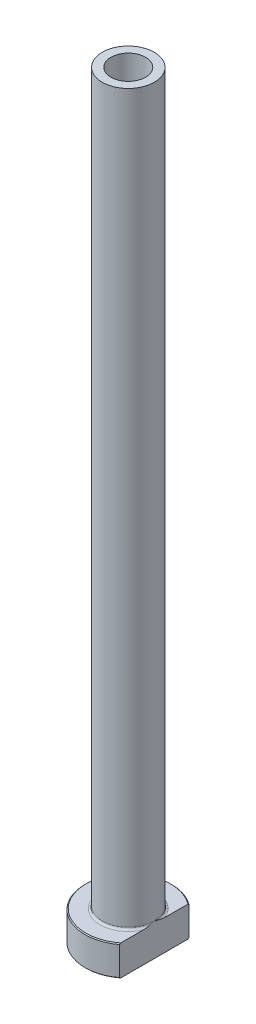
ISO-10303-21;
HEADER;
FILE_DESCRIPTION(('STEP AP214'),'2;1');
FILE_NAME('part.step','',(''),(''),'','','');
FILE_SCHEMA(('AUTOMOTIVE_DESIGN { 1 0 10303 214 1 1 1 1 }'));
ENDSEC;
DATA;
#1=APPLICATION_CONTEXT('core data for automotive mechanical design processes');
#2=APPLICATION_PROTOCOL_DEFINITION('international standard','automotive_design',2000,#1);
#3=PRODUCT_CONTEXT('',#1,'mechanical');
#4=PRODUCT('Part','Part','',(#3));
#5=PRODUCT_RELATED_PRODUCT_CATEGORY('part','',(#4));
#6=PRODUCT_DEFINITION_FORMATION('','',#4);
#7=PRODUCT_DEFINITION_CONTEXT('part definition',#1,'design');
#8=PRODUCT_DEFINITION('design','',#6,#7);
#9=PRODUCT_DEFINITION_SHAPE('','',#8);
#10=(LENGTH_UNIT() NAMED_UNIT(*) SI_UNIT(.MILLI.,.METRE.));
#11=(NAMED_UNIT(*) PLANE_ANGLE_UNIT() SI_UNIT($,.RADIAN.));
#12=(NAMED_UNIT(*) SI_UNIT($,.STERADIAN.) SOLID_ANGLE_UNIT());
#13=UNCERTAINTY_MEASURE_WITH_UNIT(LENGTH_MEASURE(1.E-05),#10,'distance_accuracy_value','');
#14=(GEOMETRIC_REPRESENTATION_CONTEXT(3) GLOBAL_UNCERTAINTY_ASSIGNED_CONTEXT((#13)) GLOBAL_UNIT_ASSIGNED_CONTEXT((#10,
#11,#12)) REPRESENTATION_CONTEXT('',''));
#15=CARTESIAN_POINT('',(0.,0.,0.));
#16=DIRECTION('',(0.,0.,1.));
#17=DIRECTION('',(1.,0.,0.));
#18=AXIS2_PLACEMENT_3D('',#15,#16,#17);
#19=CARTESIAN_POINT('',(0.,92.1876809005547,0.));
#20=DIRECTION('',(0.,1.,0.));
#21=DIRECTION('',(0.,0.,1.));
#22=AXIS2_PLACEMENT_3D('',#19,#20,#21);
#23=CYLINDRICAL_SURFACE('',#22,4.);
#24=CARTESIAN_POINT('',(0.,175.,0.));
#25=DIRECTION('',(0.,1.,0.));
#26=DIRECTION('',(0.,0.,1.));
#27=AXIS2_PLACEMENT_3D('',#24,#25,#26);
#28=CIRCLE('',#27,4.);
#29=CARTESIAN_POINT('',(0.,175.,4.));
#30=VERTEX_POINT('',#29);
#31=EDGE_CURVE('E167',#30,#30,#28,.T.);
#32=ORIENTED_EDGE('',*,*,#31,.T.);
#33=EDGE_LOOP('',(#32));
#34=FACE_BOUND('',#33,.T.);
#35=CARTESIAN_POINT('',(0.,130.,0.));
#36=DIRECTION('',(0.,1.,0.));
#37=DIRECTION('',(0.,0.,1.));
#38=AXIS2_PLACEMENT_3D('',#35,#36,#37);
#39=CIRCLE('',#38,4.);
#40=CARTESIAN_POINT('',(0.,130.,4.));
#41=VERTEX_POINT('',#40);
#42=EDGE_CURVE('E170',#41,#41,#39,.T.);
#43=ORIENTED_EDGE('',*,*,#42,.F.);
#44=EDGE_LOOP('',(#43));
#45=FACE_BOUND('',#44,.T.);
#46=ADVANCED_FACE('F32',(#34,#45),#23,.F.);
#47=CARTESIAN_POINT('',(-4.,175.,0.));
#48=DIRECTION('',(0.,1.,0.));
#49=DIRECTION('',(0.,0.,1.));
#50=AXIS2_PLACEMENT_3D('',#47,#48,#49);
#51=PLANE('',#50);
#52=CARTESIAN_POINT('',(0.,175.,0.));
#53=DIRECTION('',(0.,1.,0.));
#54=DIRECTION('',(0.,0.,1.));
#55=AXIS2_PLACEMENT_3D('',#52,#53,#54);
#56=CIRCLE('',#55,6.00000000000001);
#57=CARTESIAN_POINT('',(0.,175.,6.00000000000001));
#58=VERTEX_POINT('',#57);
#59=EDGE_CURVE('E174',#58,#58,#56,.T.);
#60=ORIENTED_EDGE('',*,*,#59,.T.);
#61=EDGE_LOOP('',(#60));
#62=FACE_BOUND('',#61,.T.);
#63=ORIENTED_EDGE('',*,*,#31,.F.);
#64=EDGE_LOOP('',(#63));
#65=FACE_BOUND('',#64,.T.);
#66=ADVANCED_FACE('F157',(#62,#65),#51,.T.);
#67=CARTESIAN_POINT('',(0.,92.1876809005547,0.));
#68=DIRECTION('',(0.,1.,0.));
#69=DIRECTION('',(0.,0.,1.));
#70=AXIS2_PLACEMENT_3D('',#67,#68,#69);
#71=CYLINDRICAL_SURFACE('',#70,6.);
#72=CARTESIAN_POINT('',(0.,7.50000000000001,0.));
#73=DIRECTION('',(0.,1.,0.));
#74=DIRECTION('',(0.,0.,1.));
#75=AXIS2_PLACEMENT_3D('',#72,#73,#74);
#76=CIRCLE('',#75,6.);
#77=CARTESIAN_POINT('',(6.,7.50000000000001,0.));
#78=VERTEX_POINT('',#77);
#79=EDGE_CURVE('E180',#78,#78,#76,.T.);
#80=ORIENTED_EDGE('',*,*,#79,.T.);
#81=EDGE_LOOP('',(#80));
#82=FACE_BOUND('',#81,.T.);
#83=ORIENTED_EDGE('',*,*,#59,.F.);
#84=EDGE_LOOP('',(#83));
#85=FACE_BOUND('',#84,.T.);
#86=ADVANCED_FACE('F162',(#82,#85),#71,.T.);
#87=CARTESIAN_POINT('',(-5.99999999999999,7.,0.));
#88=DIRECTION('',(0.,1.,0.));
#89=DIRECTION('',(0.,0.,1.));
#90=AXIS2_PLACEMENT_3D('',#87,#88,#89);
#91=PLANE('',#90);
#92=DIRECTION('',(0.,0.,1.));
#93=VECTOR('',#92,1.);
#94=CARTESIAN_POINT('',(6.,7.,0.));
#95=LINE('',#94,#93);
#96=CARTESIAN_POINT('',(6.,7.,-7.74854825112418));
#97=VERTEX_POINT('',#96);
#98=CARTESIAN_POINT('',(6.,7.,-2.50000000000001));
#99=VERTEX_POINT('',#98);
#100=EDGE_CURVE('E54',#97,#99,#95,.T.);
#101=ORIENTED_EDGE('',*,*,#100,.F.);
#102=CARTESIAN_POINT('',(0.,7.,0.));
#103=DIRECTION('',(0.,1.,0.));
#104=DIRECTION('',(0.,0.,1.));
#105=AXIS2_PLACEMENT_3D('',#102,#103,#104);
#106=CIRCLE('',#105,9.79999999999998);
#107=CARTESIAN_POINT('',(5.99999999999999,7.,7.74854825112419));
#108=VERTEX_POINT('',#107);
#109=EDGE_CURVE('E186',#97,#108,#106,.T.);
#110=ORIENTED_EDGE('',*,*,#109,.T.);
#111=CARTESIAN_POINT('',(6.,7.,2.50000000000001));
#112=VERTEX_POINT('',#111);
#113=EDGE_CURVE('E134',#112,#108,#95,.T.);
#114=ORIENTED_EDGE('',*,*,#113,.F.);
#115=CARTESIAN_POINT('',(0.,7.,0.));
#116=DIRECTION('',(0.,1.,0.));
#117=DIRECTION('',(0.,0.,1.));
#118=AXIS2_PLACEMENT_3D('',#115,#116,#117);
#119=CIRCLE('',#118,6.5);
#120=EDGE_CURVE('E183',#112,#99,#119,.F.);
#121=ORIENTED_EDGE('',*,*,#120,.T.);
#122=EDGE_LOOP('',(#101,#110,#114,#121));
#123=FACE_BOUND('',#122,.T.);
#124=ADVANCED_FACE('F197',(#123),#91,.T.);
#125=CARTESIAN_POINT('',(0.,92.1876809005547,0.));
#126=DIRECTION('',(0.,1.,0.));
#127=DIRECTION('',(0.,0.,1.));
#128=AXIS2_PLACEMENT_3D('',#125,#126,#127);
#129=CYLINDRICAL_SURFACE('',#128,9.99999999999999);
#130=DIRECTION('',(0.,-1.,0.));
#131=VECTOR('',#130,1.);
#132=CARTESIAN_POINT('',(5.99999999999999,175.,7.99999999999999));
#133=LINE('',#132,#131);
#134=CARTESIAN_POINT('',(5.99999999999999,6.8,7.99999999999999));
#135=VERTEX_POINT('',#134);
#136=CARTESIAN_POINT('',(5.99999999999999,0.200000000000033,7.99999999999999));
#137=VERTEX_POINT('',#136);
#138=EDGE_CURVE('E82',#135,#137,#133,.T.);
#139=ORIENTED_EDGE('',*,*,#138,.F.);
#140=CARTESIAN_POINT('',(0.,6.8,0.));
#141=DIRECTION('',(0.,1.,0.));
#142=DIRECTION('',(0.,0.,1.));
#143=AXIS2_PLACEMENT_3D('',#140,#141,#142);
#144=CIRCLE('',#143,9.99999999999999);
#145=CARTESIAN_POINT('',(6.,6.8,-7.99999999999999));
#146=VERTEX_POINT('',#145);
#147=EDGE_CURVE('E95',#135,#146,#144,.F.);
#148=ORIENTED_EDGE('',*,*,#147,.T.);
#149=DIRECTION('',(0.,-1.,0.));
#150=VECTOR('',#149,1.);
#151=CARTESIAN_POINT('',(6.,175.,-7.99999999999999));
#152=LINE('',#151,#150);
#153=CARTESIAN_POINT('',(6.,0.200000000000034,-7.99999999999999));
#154=VERTEX_POINT('',#153);
#155=EDGE_CURVE('E192',#146,#154,#152,.T.);
#156=ORIENTED_EDGE('',*,*,#155,.T.);
#157=CARTESIAN_POINT('',(0.,0.200000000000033,0.));
#158=DIRECTION('',(0.,-1.,0.));
#159=DIRECTION('',(0.,0.,-1.));
#160=AXIS2_PLACEMENT_3D('',#157,#158,#159);
#161=CIRCLE('',#160,9.99999999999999);
#162=EDGE_CURVE('E98',#154,#137,#161,.F.);
#163=ORIENTED_EDGE('',*,*,#162,.T.);
#164=EDGE_LOOP('',(#139,#148,#156,#163));
#165=FACE_BOUND('',#164,.T.);
#166=ADVANCED_FACE('F190',(#165),#129,.T.);
#167=CARTESIAN_POINT('',(-9.99999999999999,0.,0.));
#168=DIRECTION('',(0.,-1.,0.));
#169=DIRECTION('',(0.,0.,-1.));
#170=AXIS2_PLACEMENT_3D('',#167,#168,#169);
#171=PLANE('',#170);
#172=CARTESIAN_POINT('',(0.,0.,0.));
#173=DIRECTION('',(0.,-1.,0.));
#174=DIRECTION('',(0.,0.,-1.));
#175=AXIS2_PLACEMENT_3D('',#172,#173,#174);
#176=CIRCLE('',#175,4.74999999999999);
#177=CARTESIAN_POINT('',(0.,0.,-4.74999999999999));
#178=VERTEX_POINT('',#177);
#179=EDGE_CURVE('E40',#178,#178,#176,.F.);
#180=ORIENTED_EDGE('',*,*,#179,.T.);
#181=EDGE_LOOP('',(#180));
#182=FACE_BOUND('',#181,.T.);
#183=DIRECTION('',(0.,0.,-1.));
#184=VECTOR('',#183,1.);
#185=CARTESIAN_POINT('',(5.99999999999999,0.,7.99999999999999));
#186=LINE('',#185,#184);
#187=CARTESIAN_POINT('',(5.99999999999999,0.,7.74854825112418));
#188=VERTEX_POINT('',#187);
#189=CARTESIAN_POINT('',(6.,0.,-7.74854825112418));
#190=VERTEX_POINT('',#189);
#191=EDGE_CURVE('E47',#188,#190,#186,.T.);
#192=ORIENTED_EDGE('',*,*,#191,.F.);
#193=CARTESIAN_POINT('',(0.,0.,0.));
#194=DIRECTION('',(0.,-1.,0.));
#195=DIRECTION('',(0.,0.,-1.));
#196=AXIS2_PLACEMENT_3D('',#193,#194,#195);
#197=CIRCLE('',#196,9.79999999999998);
#198=EDGE_CURVE('E92',#188,#190,#197,.T.);
#199=ORIENTED_EDGE('',*,*,#198,.T.);
#200=EDGE_LOOP('',(#192,#199));
#201=FACE_BOUND('',#200,.T.);
#202=ADVANCED_FACE('F91',(#182,#201),#171,.T.);
#203=CARTESIAN_POINT('',(0.,92.1876809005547,0.));
#204=DIRECTION('',(0.,1.,0.));
#205=DIRECTION('',(0.,0.,1.));
#206=AXIS2_PLACEMENT_3D('',#203,#204,#205);
#207=CYLINDRICAL_SURFACE('',#206,4.25);
#208=CARTESIAN_POINT('',(0.,0.499999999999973,0.));
#209=DIRECTION('',(0.,-1.,0.));
#210=DIRECTION('',(0.,0.,-1.));
#211=AXIS2_PLACEMENT_3D('',#208,#209,#210);
#212=CIRCLE('',#211,4.25);
#213=CARTESIAN_POINT('',(0.,0.499999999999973,-4.25));
#214=VERTEX_POINT('',#213);
#215=EDGE_CURVE('E11',#214,#214,#212,.T.);
#216=ORIENTED_EDGE('',*,*,#215,.T.);
#217=EDGE_LOOP('',(#216));
#218=FACE_BOUND('',#217,.T.);
#219=CARTESIAN_POINT('',(0.,118.,0.));
#220=DIRECTION('',(0.,1.,0.));
#221=DIRECTION('',(0.,0.,1.));
#222=AXIS2_PLACEMENT_3D('',#219,#220,#221);
#223=CIRCLE('',#222,4.25000000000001);
#224=CARTESIAN_POINT('',(0.,118.,4.25000000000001));
#225=VERTEX_POINT('',#224);
#226=EDGE_CURVE('E172',#225,#225,#223,.T.);
#227=ORIENTED_EDGE('',*,*,#226,.T.);
#228=EDGE_LOOP('',(#227));
#229=FACE_BOUND('',#228,.T.);
#230=ADVANCED_FACE('F215',(#218,#229),#207,.F.);
#231=CARTESIAN_POINT('',(0.,118.,0.));
#232=DIRECTION('',(0.,-1.,0.));
#233=DIRECTION('',(0.,0.,-1.));
#234=AXIS2_PLACEMENT_3D('',#231,#232,#233);
#235=CONICAL_SURFACE('',#234,4.25000000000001,0.0208303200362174);
#236=ORIENTED_EDGE('',*,*,#42,.T.);
#237=EDGE_LOOP('',(#236));
#238=FACE_BOUND('',#237,.T.);
#239=ORIENTED_EDGE('',*,*,#226,.F.);
#240=EDGE_LOOP('',(#239));
#241=FACE_BOUND('',#240,.T.);
#242=ADVANCED_FACE('F111',(#238,#241),#235,.F.);
#243=CARTESIAN_POINT('',(0.,7.50000000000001,0.));
#244=DIRECTION('',(0.,1.,0.));
#245=DIRECTION('',(0.,0.,1.));
#246=AXIS2_PLACEMENT_3D('',#243,#244,#245);
#247=TOROIDAL_SURFACE('',#246,6.5,0.5);
#248=ORIENTED_EDGE('',*,*,#120,.F.);
#249=CARTESIAN_POINT('',(6.,7.50000000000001,0.));
#250=CARTESIAN_POINT('',(6.,7.50000080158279,6.70437983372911E-11));
#251=CARTESIAN_POINT('',(6.,7.50000160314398,2.62462697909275E-07));
#252=CARTESIAN_POINT('',(6.,7.50000311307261,1.01907195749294E-06));
#253=CARTESIAN_POINT('',(6.,7.50000381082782,1.52837938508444E-06));
#254=CARTESIAN_POINT('',(6.,7.50000523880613,2.74467627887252E-06));
#255=CARTESIAN_POINT('',(6.,7.50000595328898,3.47066742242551E-06));
#256=CARTESIAN_POINT('',(6.,7.50000725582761,4.99336203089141E-06));
#257=CARTESIAN_POINT('',(6.,7.50000784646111,5.78800142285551E-06));
#258=CARTESIAN_POINT('',(6.,7.50000997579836,8.79661618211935E-06));
#259=CARTESIAN_POINT('',(6.,7.50001139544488,1.10980677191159E-05));
#260=CARTESIAN_POINT('',(6.,7.50001378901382,1.57116099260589E-05));
#261=CARTESIAN_POINT('',(6.,7.5000147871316,1.80117446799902E-05));
#262=CARTESIAN_POINT('',(6.,7.5000188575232,2.75423845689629E-05));
#263=CARTESIAN_POINT('',(6.,7.50002181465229,3.48285091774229E-05));
#264=CARTESIAN_POINT('',(6.,7.50002628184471,4.87408411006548E-05));
#265=CARTESIAN_POINT('',(6.,7.50002793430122,5.53214394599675E-05));
#266=CARTESIAN_POINT('',(6.,7.50003978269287,0.000103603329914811));
#267=CARTESIAN_POINT('',(6.,7.50004857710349,0.000145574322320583));
#268=CARTESIAN_POINT('',(5.99999999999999,7.50008704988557,0.000310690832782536));
#269=CARTESIAN_POINT('',(5.99999999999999,7.50012394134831,0.000432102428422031));
#270=CARTESIAN_POINT('',(6.,7.50026686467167,0.000911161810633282));
#271=CARTESIAN_POINT('',(6.,7.50036807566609,0.00126981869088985));
#272=CARTESIAN_POINT('',(5.99999999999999,7.50077195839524,0.00268961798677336));
#273=CARTESIAN_POINT('',(5.99999999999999,7.501080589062,0.00374948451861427));
#274=CARTESIAN_POINT('',(6.00000000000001,7.50236320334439,0.00816658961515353));
#275=CARTESIAN_POINT('',(6.,7.50332976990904,0.011525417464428));
#276=CARTESIAN_POINT('',(5.99999999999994,7.51709821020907,0.0593544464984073));
#277=CARTESIAN_POINT('',(5.99999999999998,7.52995465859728,0.103813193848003));
#278=CARTESIAN_POINT('',(6.00000000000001,7.55506029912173,0.190977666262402));
#279=CARTESIAN_POINT('',(6.,7.56731321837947,0.233682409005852));
#280=CARTESIAN_POINT('',(5.99999999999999,7.59325665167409,0.324512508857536));
#281=CARTESIAN_POINT('',(5.99999999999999,7.6069334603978,0.372641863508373));
#282=CARTESIAN_POINT('',(6.,7.63422038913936,0.469489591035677));
#283=CARTESIAN_POINT('',(6.,7.64782813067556,0.518208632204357));
#284=CARTESIAN_POINT('',(5.99999999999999,7.68043734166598,0.636338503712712));
#285=CARTESIAN_POINT('',(6.,7.69928754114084,0.705791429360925));
#286=CARTESIAN_POINT('',(6.,7.73566887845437,0.843102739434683));
#287=CARTESIAN_POINT('',(6.,7.7532216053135,0.910955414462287));
#288=CARTESIAN_POINT('',(6.,7.80024878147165,1.09857433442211));
#289=CARTESIAN_POINT('',(6.,7.82864900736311,1.21861610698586));
#290=CARTESIAN_POINT('',(6.,7.88105633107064,1.46081534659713));
#291=CARTESIAN_POINT('',(6.,7.90502088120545,1.58298212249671));
#292=CARTESIAN_POINT('',(6.,7.94810499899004,1.83866408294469));
#293=CARTESIAN_POINT('',(6.,7.96665856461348,1.97228081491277));
#294=CARTESIAN_POINT('',(6.,7.98621697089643,2.17329578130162));
#295=CARTESIAN_POINT('',(6.,7.99135613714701,2.24029152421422));
#296=CARTESIAN_POINT('',(6.,7.99832928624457,2.37444824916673));
#297=CARTESIAN_POINT('',(6.,8.00016429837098,2.44160917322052));
#298=CARTESIAN_POINT('',(6.,7.99984674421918,2.56298631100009));
#299=CARTESIAN_POINT('',(6.,7.99839439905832,2.61720324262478));
#300=CARTESIAN_POINT('',(6.,7.99236557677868,2.72552036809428));
#301=CARTESIAN_POINT('',(6.,7.98778645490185,2.77962042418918));
#302=CARTESIAN_POINT('',(6.,7.97492915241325,2.88664710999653));
#303=CARTESIAN_POINT('',(6.,7.96670262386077,2.93957965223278));
#304=CARTESIAN_POINT('',(6.,7.94570253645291,3.04448333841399));
#305=CARTESIAN_POINT('',(6.,7.93293488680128,3.09645563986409));
#306=CARTESIAN_POINT('',(6.,7.90135968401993,3.19943606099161));
#307=CARTESIAN_POINT('',(6.,7.88247175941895,3.25042120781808));
#308=CARTESIAN_POINT('',(6.,7.84818685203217,3.32403783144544));
#309=CARTESIAN_POINT('',(6.,7.83579052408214,3.34806431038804));
#310=CARTESIAN_POINT('',(6.,7.80866016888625,3.39474488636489));
#311=CARTESIAN_POINT('',(6.,7.79392968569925,3.41740099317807));
#312=CARTESIAN_POINT('',(6.,7.76577135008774,3.45524173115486));
#313=CARTESIAN_POINT('',(6.,7.752947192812,3.47087266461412));
#314=CARTESIAN_POINT('',(6.,7.72556313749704,3.50058040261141));
#315=CARTESIAN_POINT('',(6.,7.71100204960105,3.51465612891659));
#316=CARTESIAN_POINT('',(6.,7.67984897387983,3.54077006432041));
#317=CARTESIAN_POINT('',(6.,7.66323651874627,3.55278430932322));
#318=CARTESIAN_POINT('',(6.,7.62815222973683,3.57370259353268));
#319=CARTESIAN_POINT('',(6.,7.60968501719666,3.58261412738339));
#320=CARTESIAN_POINT('',(6.,7.57639898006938,3.59454653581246));
#321=CARTESIAN_POINT('',(6.,7.56191673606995,3.59850385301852));
#322=CARTESIAN_POINT('',(6.,7.53249228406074,3.60392336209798));
#323=CARTESIAN_POINT('',(6.,7.51755044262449,3.60538749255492));
#324=CARTESIAN_POINT('',(6.,7.48761833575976,3.60568912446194));
#325=CARTESIAN_POINT('',(6.,7.47262803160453,3.60452285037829));
#326=CARTESIAN_POINT('',(6.,7.44306278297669,3.59966500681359));
#327=CARTESIAN_POINT('',(6.,7.42848812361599,3.5959717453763));
#328=CARTESIAN_POINT('',(6.,7.39702156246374,3.5853110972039));
#329=CARTESIAN_POINT('',(6.,7.38031267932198,3.57780732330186));
#330=CARTESIAN_POINT('',(6.,7.34834450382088,3.56018434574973));
#331=CARTESIAN_POINT('',(6.,7.33308764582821,3.55006085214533));
#332=CARTESIAN_POINT('',(6.,7.29715308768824,3.52252389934));
#333=CARTESIAN_POINT('',(6.,7.2773783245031,3.50394102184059));
#334=CARTESIAN_POINT('',(6.,7.24088410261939,3.46399503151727));
#335=CARTESIAN_POINT('',(6.,7.22417302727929,3.44262455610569));
#336=CARTESIAN_POINT('',(6.,7.18148338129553,3.38088102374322));
#337=CARTESIAN_POINT('',(6.,7.15831783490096,3.33858120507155));
#338=CARTESIAN_POINT('',(6.,7.11822747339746,3.25128083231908));
#339=CARTESIAN_POINT('',(6.,7.10130560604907,3.20627901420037));
#340=CARTESIAN_POINT('',(6.,7.07193388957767,3.11375892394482));
#341=CARTESIAN_POINT('',(6.,7.05959256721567,3.06620687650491));
#342=CARTESIAN_POINT('',(6.,7.03888782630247,2.97022063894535));
#343=CARTESIAN_POINT('',(6.,7.03052890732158,2.92178551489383));
#344=CARTESIAN_POINT('',(6.,7.01697563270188,2.82374574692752));
#345=CARTESIAN_POINT('',(6.,7.01183067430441,2.77413446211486));
#346=CARTESIAN_POINT('',(6.,7.00435015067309,2.67475263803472));
#347=CARTESIAN_POINT('',(6.,7.00201229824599,2.62498226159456));
#348=CARTESIAN_POINT('',(6.,6.9989719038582,2.49377014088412));
#349=CARTESIAN_POINT('',(6.,7.00025005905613,2.41228296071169));
#350=CARTESIAN_POINT('',(6.,7.00775652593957,2.24952135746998));
#351=CARTESIAN_POINT('',(6.,7.01398784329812,2.16824709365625));
#352=CARTESIAN_POINT('',(6.,7.03045087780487,2.00575531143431));
#353=CARTESIAN_POINT('',(6.,7.0407000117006,1.92453960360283));
#354=CARTESIAN_POINT('',(6.,7.06442774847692,1.76257601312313));
#355=CARTESIAN_POINT('',(6.,7.07790697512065,1.68182822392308));
#356=CARTESIAN_POINT('',(6.,7.11973611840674,1.45394312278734));
#357=CARTESIAN_POINT('',(6.,7.15113840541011,1.30736987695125));
#358=CARTESIAN_POINT('',(6.,7.21927147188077,1.01717316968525));
#359=CARTESIAN_POINT('',(6.,7.25594155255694,0.87353492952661));
#360=CARTESIAN_POINT('',(6.,7.3076575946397,0.680321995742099));
#361=CARTESIAN_POINT('',(6.,7.32124979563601,0.630351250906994));
#362=CARTESIAN_POINT('',(6.,7.34913735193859,0.529103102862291));
#363=CARTESIAN_POINT('',(6.,7.36344174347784,0.477828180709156));
#364=CARTESIAN_POINT('',(6.,7.38809313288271,0.390268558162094));
#365=CARTESIAN_POINT('',(6.,7.39837954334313,0.353966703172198));
#366=CARTESIAN_POINT('',(6.,7.41893445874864,0.281778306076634));
#367=CARTESIAN_POINT('',(6.,7.42920197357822,0.245891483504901));
#368=CARTESIAN_POINT('',(6.,7.44864004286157,0.17813745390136));
#369=CARTESIAN_POINT('',(5.99999999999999,7.45780513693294,0.146268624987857));
#370=CARTESIAN_POINT('',(6.,7.47656016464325,0.0812304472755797));
#371=CARTESIAN_POINT('',(6.,7.48615204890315,0.048061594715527));
#372=CARTESIAN_POINT('',(6.,7.49666961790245,0.011527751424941));
#373=CARTESIAN_POINT('',(5.99999999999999,7.49763547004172,0.00817123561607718));
#374=CARTESIAN_POINT('',(6.,7.49891791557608,0.00375466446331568));
#375=CARTESIAN_POINT('',(6.,7.49922706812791,0.00269301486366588));
#376=CARTESIAN_POINT('',(6.,7.49963158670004,0.00127098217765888));
#377=CARTESIAN_POINT('',(5.99999999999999,7.4997329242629,0.000911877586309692));
#378=CARTESIAN_POINT('',(6.,7.49987600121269,0.000432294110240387));
#379=CARTESIAN_POINT('',(6.,7.49991291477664,0.000310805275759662));
#380=CARTESIAN_POINT('',(6.,7.49995140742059,0.00014559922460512));
#381=CARTESIAN_POINT('',(6.,7.49996020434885,0.000103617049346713));
#382=CARTESIAN_POINT('',(6.,7.49997205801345,5.53238222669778E-05));
#383=CARTESIAN_POINT('',(6.,7.49997371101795,4.87425698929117E-05));
#384=CARTESIAN_POINT('',(6.,7.49997817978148,3.48289259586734E-05));
#385=CARTESIAN_POINT('',(6.,7.49998113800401,2.75421776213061E-05));
#386=CARTESIAN_POINT('',(6.,7.49998520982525,1.80109010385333E-05));
#387=CARTESIAN_POINT('',(6.,7.49998620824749,1.57107171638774E-05));
#388=CARTESIAN_POINT('',(6.,7.49998860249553,1.10971295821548E-05));
#389=CARTESIAN_POINT('',(6.,7.49999002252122,8.79568731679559E-06));
#390=CARTESIAN_POINT('',(6.,7.49999215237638,5.78714743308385E-06));
#391=CARTESIAN_POINT('',(6.,7.499992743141,4.99254395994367E-06));
#392=CARTESIAN_POINT('',(6.,7.49999404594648,3.46994484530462E-06));
#393=CARTESIAN_POINT('',(6.,7.4999947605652,2.74401393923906E-06));
#394=CARTESIAN_POINT('',(6.,7.49999618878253,1.52786000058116E-06));
#395=CARTESIAN_POINT('',(6.,7.49999688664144,1.01863047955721E-06));
#396=CARTESIAN_POINT('',(6.,7.49999839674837,2.62215617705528E-07));
#397=CARTESIAN_POINT('',(6.,7.49999919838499,-6.70451932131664E-11));
#398=CARTESIAN_POINT('',(6.,7.50000000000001,0.));
#399=B_SPLINE_CURVE_WITH_KNOTS('',3,(#249,#250,#251,#252,#253,#254,#255,#256,#257,#258,#259,
#260,#261,#262,#263,#264,#265,#266,#267,#268,#269,#270,#271,#272,#273,#274,#275,#276,#277,#278,
#279,#280,#281,#282,#283,#284,#285,#286,#287,#288,#289,#290,#291,#292,#293,#294,#295,#296,#297,
#298,#299,#300,#301,#302,#303,#304,#305,#306,#307,#308,#309,#310,#311,#312,#313,#314,#315,#316,
#317,#318,#319,#320,#321,#322,#323,#324,#325,#326,#327,#328,#329,#330,#331,#332,#333,#334,#335,
#336,#337,#338,#339,#340,#341,#342,#343,#344,#345,#346,#347,#348,#349,#350,#351,#352,#353,#354,
#355,#356,#357,#358,#359,#360,#361,#362,#363,#364,#365,#366,#367,#368,#369,#370,#371,#372,#373,
#374,#375,#376,#377,#378,#379,#380,#381,#382,#383,#384,#385,#386,#387,#388,#389,#390,#391,#392,
#393,#394,#395,#396,#397,#398),.UNSPECIFIED.,.T.,.F.,(4,2,2,2,2,2,2,2,2,2,2,2,2,2,2,2,2,2,2,2,2,
2,2,2,2,2,2,2,2,2,2,2,2,2,2,2,2,2,2,2,2,2,2,2,2,2,2,2,2,2,2,2,2,2,2,2,2,2,2,2,2,2,2,2,2,2,2,2,2,
2,2,2,2,2,4),(0.,2.41532916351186E-06,5.00161904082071E-06,8.0411611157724E-06,
1.10092332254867E-05,1.9088976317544E-05,2.66047401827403E-05,5.01454106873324E-05,
7.04740061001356E-05,0.000199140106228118,0.000579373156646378,0.00169781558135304,
0.00500893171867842,0.0154949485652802,0.154330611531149,0.28761521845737,0.437719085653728,
0.589470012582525,0.805361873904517,1.01561737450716,1.38561400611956,1.75899405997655,
2.1633128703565,2.36482907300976,2.56628249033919,2.72891861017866,2.89169246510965,
3.05223140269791,3.21256219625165,3.37509011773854,3.45609970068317,3.53698744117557,
3.59753760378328,3.65812948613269,3.7193839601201,3.78048942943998,3.82533702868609,
3.87014974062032,3.91502681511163,3.95993396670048,4.01458097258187,4.06931803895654,
4.15026803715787,4.23143634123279,4.37530581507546,4.51924312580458,4.66640085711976,
4.81372446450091,4.96325999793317,5.1126736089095,5.35695170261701,5.60137814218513,
5.84687607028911,6.09242144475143,6.54191534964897,6.98659302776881,7.14195169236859,
7.30164895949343,7.41484221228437,7.52682205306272,7.62630458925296,7.72988447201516,
7.74036324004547,7.74367992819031,7.74479976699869,7.74518024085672,7.74530894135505,
7.74532927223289,7.74535281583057,7.74536033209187,7.74536841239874,7.74537138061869,
7.74537442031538,7.74537700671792,7.74537942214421),.UNSPECIFIED.);
#400=EDGE_CURVE('E126',#112,#78,#399,.T.);
#401=ORIENTED_EDGE('',*,*,#400,.T.);
#402=ORIENTED_EDGE('',*,*,#79,.F.);
#403=CARTESIAN_POINT('',(6.,7.50000000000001,0.));
#404=CARTESIAN_POINT('',(6.,7.49999919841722,-6.70426601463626E-11));
#405=CARTESIAN_POINT('',(6.,7.49999839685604,-2.624626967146E-07));
#406=CARTESIAN_POINT('',(6.,7.4999968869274,-1.01907195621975E-06));
#407=CARTESIAN_POINT('',(6.,7.49999618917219,-1.52837938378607E-06));
#408=CARTESIAN_POINT('',(6.,7.49999476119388,-2.74467627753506E-06));
#409=CARTESIAN_POINT('',(6.,7.49999404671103,-3.47066742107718E-06));
#410=CARTESIAN_POINT('',(6.,7.4999927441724,-4.99336202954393E-06));
#411=CARTESIAN_POINT('',(6.,7.49999215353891,-5.78800142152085E-06));
#412=CARTESIAN_POINT('',(6.,7.49999002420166,-8.79661618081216E-06));
#413=CARTESIAN_POINT('',(6.,7.49998860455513,-1.10980677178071E-05));
#414=CARTESIAN_POINT('',(6.,7.4999862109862,-1.57116099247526E-05));
#415=CARTESIAN_POINT('',(6.,7.49998521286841,-1.8011744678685E-05));
#416=CARTESIAN_POINT('',(6.,7.49998114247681,-2.7542384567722E-05));
#417=CARTESIAN_POINT('',(6.,7.49997818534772,-3.48285091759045E-05));
#418=CARTESIAN_POINT('',(6.,7.4999737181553,-4.87408410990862E-05));
#419=CARTESIAN_POINT('',(6.,7.49997206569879,-5.53214394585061E-05));
#420=CARTESIAN_POINT('',(6.,7.49996021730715,-0.000103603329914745));
#421=CARTESIAN_POINT('',(6.,7.49995142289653,-0.000145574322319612));
#422=CARTESIAN_POINT('',(5.99999999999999,7.49991295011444,-0.000310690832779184));
#423=CARTESIAN_POINT('',(5.99999999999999,7.4998760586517,-0.000432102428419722));
#424=CARTESIAN_POINT('',(6.,7.49973313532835,-0.000911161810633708));
#425=CARTESIAN_POINT('',(6.,7.49963192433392,-0.00126981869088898));
#426=CARTESIAN_POINT('',(5.99999999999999,7.49922804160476,-0.00268961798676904));
#427=CARTESIAN_POINT('',(5.99999999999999,7.49891941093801,-0.00374948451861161));
#428=CARTESIAN_POINT('',(6.00000000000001,7.49763679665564,-0.00816658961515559));
#429=CARTESIAN_POINT('',(6.,7.49667023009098,-0.0115254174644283));
#430=CARTESIAN_POINT('',(5.99999999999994,7.48290178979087,-0.0593544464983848));
#431=CARTESIAN_POINT('',(5.99999999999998,7.47004534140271,-0.103813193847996));
#432=CARTESIAN_POINT('',(6.00000000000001,7.4449397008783,-0.190977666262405));
#433=CARTESIAN_POINT('',(6.,7.43268678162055,-0.233682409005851));
#434=CARTESIAN_POINT('',(5.99999999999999,7.40674334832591,-0.324512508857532));
#435=CARTESIAN_POINT('',(5.99999999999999,7.39306653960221,-0.372641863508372));
#436=CARTESIAN_POINT('',(6.,7.36577961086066,-0.469489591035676));
#437=CARTESIAN_POINT('',(6.,7.35217186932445,-0.518208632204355));
#438=CARTESIAN_POINT('',(5.99999999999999,7.31956265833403,-0.636338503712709));
#439=CARTESIAN_POINT('',(6.,7.30071245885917,-0.705791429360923));
#440=CARTESIAN_POINT('',(6.,7.26433112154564,-0.843102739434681));
#441=CARTESIAN_POINT('',(6.,7.24677839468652,-0.910955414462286));
#442=CARTESIAN_POINT('',(6.,7.19975121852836,-1.09857433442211));
#443=CARTESIAN_POINT('',(6.,7.17135099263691,-1.21861610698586));
#444=CARTESIAN_POINT('',(6.,7.11894366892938,-1.46081534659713));
#445=CARTESIAN_POINT('',(6.,7.09497911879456,-1.58298212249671));
#446=CARTESIAN_POINT('',(6.,7.05189500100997,-1.8386640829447));
#447=CARTESIAN_POINT('',(6.,7.03334143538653,-1.97228081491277));
#448=CARTESIAN_POINT('',(6.,7.01378302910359,-2.17329578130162));
#449=CARTESIAN_POINT('',(6.,7.008643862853,-2.24029152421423));
#450=CARTESIAN_POINT('',(6.,7.00167071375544,-2.37444824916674));
#451=CARTESIAN_POINT('',(6.,6.99983570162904,-2.44160917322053));
#452=CARTESIAN_POINT('',(6.,7.00015325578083,-2.56298631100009));
#453=CARTESIAN_POINT('',(6.,7.00160560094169,-2.61720324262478));
#454=CARTESIAN_POINT('',(6.,7.00763442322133,-2.72552036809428));
#455=CARTESIAN_POINT('',(6.,7.01221354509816,-2.77962042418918));
#456=CARTESIAN_POINT('',(6.,7.02507084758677,-2.88664710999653));
#457=CARTESIAN_POINT('',(6.,7.03329737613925,-2.93957965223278));
#458=CARTESIAN_POINT('',(6.,7.0542974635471,-3.04448333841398));
#459=CARTESIAN_POINT('',(6.,7.06706511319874,-3.09645563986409));
#460=CARTESIAN_POINT('',(6.,7.09864031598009,-3.19943606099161));
#461=CARTESIAN_POINT('',(6.,7.11752824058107,-3.25042120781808));
#462=CARTESIAN_POINT('',(6.,7.15181314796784,-3.32403783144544));
#463=CARTESIAN_POINT('',(6.,7.16420947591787,-3.34806431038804));
#464=CARTESIAN_POINT('',(6.,7.19133983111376,-3.39474488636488));
#465=CARTESIAN_POINT('',(6.,7.20607031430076,-3.41740099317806));
#466=CARTESIAN_POINT('',(6.,7.23422864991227,-3.45524173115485));
#467=CARTESIAN_POINT('',(6.,7.24705280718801,-3.47087266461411));
#468=CARTESIAN_POINT('',(6.,7.27443686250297,-3.5005804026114));
#469=CARTESIAN_POINT('',(6.,7.28899795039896,-3.51465612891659));
#470=CARTESIAN_POINT('',(6.,7.32015102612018,-3.5407700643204));
#471=CARTESIAN_POINT('',(6.,7.33676348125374,-3.55278430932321));
#472=CARTESIAN_POINT('',(6.,7.37184777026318,-3.57370259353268));
#473=CARTESIAN_POINT('',(6.,7.39031498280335,-3.58261412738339));
#474=CARTESIAN_POINT('',(6.,7.42360101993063,-3.59454653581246));
#475=CARTESIAN_POINT('',(6.,7.43808326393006,-3.59850385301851));
#476=CARTESIAN_POINT('',(6.,7.46750771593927,-3.60392336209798));
#477=CARTESIAN_POINT('',(6.,7.48244955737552,-3.60538749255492));
#478=CARTESIAN_POINT('',(6.,7.51238166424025,-3.60568912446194));
#479=CARTESIAN_POINT('',(6.,7.52737196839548,-3.60452285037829));
#480=CARTESIAN_POINT('',(6.,7.55693721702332,-3.59966500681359));
#481=CARTESIAN_POINT('',(6.,7.57151187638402,-3.5959717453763));
#482=CARTESIAN_POINT('',(6.,7.60297843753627,-3.5853110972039));
#483=CARTESIAN_POINT('',(6.,7.61968732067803,-3.57780732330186));
#484=CARTESIAN_POINT('',(6.,7.65165549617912,-3.56018434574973));
#485=CARTESIAN_POINT('',(6.,7.66691235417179,-3.55006085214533));
#486=CARTESIAN_POINT('',(6.,7.70284691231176,-3.52252389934));
#487=CARTESIAN_POINT('',(6.,7.72262167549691,-3.50394102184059));
#488=CARTESIAN_POINT('',(6.,7.75911589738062,-3.46399503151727));
#489=CARTESIAN_POINT('',(6.,7.77582697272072,-3.44262455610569));
#490=CARTESIAN_POINT('',(6.,7.81851661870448,-3.38088102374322));
#491=CARTESIAN_POINT('',(6.,7.84168216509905,-3.33858120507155));
#492=CARTESIAN_POINT('',(6.,7.88177252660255,-3.25128083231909));
#493=CARTESIAN_POINT('',(6.,7.89869439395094,-3.20627901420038));
#494=CARTESIAN_POINT('',(6.,7.92806611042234,-3.11375892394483));
#495=CARTESIAN_POINT('',(6.,7.94040743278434,-3.06620687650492));
#496=CARTESIAN_POINT('',(6.,7.96111217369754,-2.97022063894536));
#497=CARTESIAN_POINT('',(6.,7.96947109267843,-2.92178551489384));
#498=CARTESIAN_POINT('',(6.,7.98302436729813,-2.82374574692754));
#499=CARTESIAN_POINT('',(6.,7.9881693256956,-2.77413446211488));
#500=CARTESIAN_POINT('',(6.,7.99564984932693,-2.67475263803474));
#501=CARTESIAN_POINT('',(6.,7.99798770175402,-2.62498226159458));
#502=CARTESIAN_POINT('',(6.,8.00102809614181,-2.49377014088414));
#503=CARTESIAN_POINT('',(6.,7.99974994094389,-2.41228296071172));
#504=CARTESIAN_POINT('',(6.,7.99224347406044,-2.24952135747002));
#505=CARTESIAN_POINT('',(6.,7.9860121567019,-2.16824709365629));
#506=CARTESIAN_POINT('',(6.,7.96954912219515,-2.00575531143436));
#507=CARTESIAN_POINT('',(6.,7.95929998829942,-1.92453960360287));
#508=CARTESIAN_POINT('',(6.,7.9355722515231,-1.76257601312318));
#509=CARTESIAN_POINT('',(6.,7.92209302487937,-1.68182822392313));
#510=CARTESIAN_POINT('',(6.,7.88026388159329,-1.4539431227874));
#511=CARTESIAN_POINT('',(6.,7.84886159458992,-1.30736987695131));
#512=CARTESIAN_POINT('',(6.,7.78072852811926,-1.01717316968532));
#513=CARTESIAN_POINT('',(6.,7.74405844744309,-0.873534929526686));
#514=CARTESIAN_POINT('',(6.,7.69234240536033,-0.680321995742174));
#515=CARTESIAN_POINT('',(6.,7.67875020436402,-0.630351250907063));
#516=CARTESIAN_POINT('',(6.,7.65086264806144,-0.529103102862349));
#517=CARTESIAN_POINT('',(6.,7.63655825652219,-0.477828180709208));
#518=CARTESIAN_POINT('',(6.,7.61190686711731,-0.390268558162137));
#519=CARTESIAN_POINT('',(6.,7.60162045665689,-0.353966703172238));
#520=CARTESIAN_POINT('',(6.,7.58106554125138,-0.281778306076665));
#521=CARTESIAN_POINT('',(6.,7.57079802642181,-0.245891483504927));
#522=CARTESIAN_POINT('',(6.,7.55135995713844,-0.178137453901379));
#523=CARTESIAN_POINT('',(5.99999999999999,7.54219486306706,-0.146268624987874));
#524=CARTESIAN_POINT('',(6.,7.52343983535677,-0.0812304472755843));
#525=CARTESIAN_POINT('',(6.,7.5138479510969,-0.0480615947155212));
#526=CARTESIAN_POINT('',(6.,7.50333038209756,-0.01152775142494));
#527=CARTESIAN_POINT('',(5.99999999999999,7.50236452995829,-0.00817123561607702));
#528=CARTESIAN_POINT('',(6.,7.50108208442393,-0.00375466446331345));
#529=CARTESIAN_POINT('',(6.,7.5007729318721,-0.00269301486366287));
#530=CARTESIAN_POINT('',(6.,7.50036841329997,-0.00127098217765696));
#531=CARTESIAN_POINT('',(5.99999999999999,7.50026707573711,-0.00091187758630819));
#532=CARTESIAN_POINT('',(6.,7.50012399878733,-0.000432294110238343));
#533=CARTESIAN_POINT('',(6.,7.50008708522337,-0.000310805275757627));
#534=CARTESIAN_POINT('',(6.,7.50004859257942,-0.00014559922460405));
#535=CARTESIAN_POINT('',(6.,7.50003979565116,-0.000103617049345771));
#536=CARTESIAN_POINT('',(6.,7.50002794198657,-5.53238222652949E-05));
#537=CARTESIAN_POINT('',(6.,7.50002628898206,-4.87425698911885E-05));
#538=CARTESIAN_POINT('',(6.,7.50002182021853,-3.48289259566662E-05));
#539=CARTESIAN_POINT('',(6.,7.50001886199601,-2.75421776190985E-05));
#540=CARTESIAN_POINT('',(6.,7.50001479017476,-1.80109010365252E-05));
#541=CARTESIAN_POINT('',(6.,7.50001379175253,-1.57107171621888E-05));
#542=CARTESIAN_POINT('',(6.,7.50001139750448,-1.10971295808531E-05));
#543=CARTESIAN_POINT('',(6.,7.50000997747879,-8.79568731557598E-06));
#544=CARTESIAN_POINT('',(6.,7.50000784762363,-5.78714743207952E-06));
#545=CARTESIAN_POINT('',(6.,7.50000725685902,-4.99254395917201E-06));
#546=CARTESIAN_POINT('',(6.,7.50000595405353,-3.46994484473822E-06));
#547=CARTESIAN_POINT('',(6.,7.50000523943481,-2.74401393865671E-06));
#548=CARTESIAN_POINT('',(6.,7.50000381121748,-1.52785999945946E-06));
#549=CARTESIAN_POINT('',(6.,7.50000311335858,-1.01863047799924E-06));
#550=CARTESIAN_POINT('',(6.,7.50000160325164,-2.62215616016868E-07));
#551=CARTESIAN_POINT('',(6.,7.50000080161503,6.70466571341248E-11));
#552=CARTESIAN_POINT('',(6.,7.50000000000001,0.));
#553=B_SPLINE_CURVE_WITH_KNOTS('',3,(#403,#404,#405,#406,#407,#408,#409,#410,#411,#412,#413,
#414,#415,#416,#417,#418,#419,#420,#421,#422,#423,#424,#425,#426,#427,#428,#429,#430,#431,#432,
#433,#434,#435,#436,#437,#438,#439,#440,#441,#442,#443,#444,#445,#446,#447,#448,#449,#450,#451,
#452,#453,#454,#455,#456,#457,#458,#459,#460,#461,#462,#463,#464,#465,#466,#467,#468,#469,#470,
#471,#472,#473,#474,#475,#476,#477,#478,#479,#480,#481,#482,#483,#484,#485,#486,#487,#488,#489,
#490,#491,#492,#493,#494,#495,#496,#497,#498,#499,#500,#501,#502,#503,#504,#505,#506,#507,#508,
#509,#510,#511,#512,#513,#514,#515,#516,#517,#518,#519,#520,#521,#522,#523,#524,#525,#526,#527,
#528,#529,#530,#531,#532,#533,#534,#535,#536,#537,#538,#539,#540,#541,#542,#543,#544,#545,#546,
#547,#548,#549,#550,#551,#552),.UNSPECIFIED.,.T.,.F.,(4,2,2,2,2,2,2,2,2,2,2,2,2,2,2,2,2,2,2,2,2,
2,2,2,2,2,2,2,2,2,2,2,2,2,2,2,2,2,2,2,2,2,2,2,2,2,2,2,2,2,2,2,2,2,2,2,2,2,2,2,2,2,2,2,2,2,2,2,2,
2,2,2,2,2,4),(0.,2.41532916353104E-06,5.00161904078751E-06,8.04116111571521E-06,
1.10092332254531E-05,1.90889763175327E-05,2.6604740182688E-05,5.01454106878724E-05,
7.04740061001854E-05,0.000199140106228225,0.000579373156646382,0.00169781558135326,
0.00500893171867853,0.0154949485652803,0.154330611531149,0.287615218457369,0.437719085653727,
0.589470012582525,0.805361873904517,1.01561737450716,1.38561400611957,1.75899405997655,
2.1633128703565,2.36482907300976,2.5662824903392,2.72891861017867,2.89169246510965,
3.05223140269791,3.21256219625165,3.37509011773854,3.45609970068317,3.53698744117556,
3.59753760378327,3.65812948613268,3.7193839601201,3.78048942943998,3.82533702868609,
3.87014974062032,3.91502681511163,3.95993396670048,4.01458097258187,4.06931803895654,
4.15026803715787,4.23143634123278,4.37530581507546,4.51924312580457,4.66640085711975,
4.81372446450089,4.96325999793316,5.11267360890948,5.35695170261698,5.60137814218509,
5.84687607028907,6.09242144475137,6.5419153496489,6.98659302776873,7.14195169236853,
7.30164895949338,7.41484221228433,7.52682205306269,7.62630458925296,7.72988447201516,
7.74036324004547,7.74367992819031,7.74479976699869,7.74518024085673,7.74530894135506,
7.74532927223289,7.74535281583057,7.74536033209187,7.74536841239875,7.74537138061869,
7.74537442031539,7.74537700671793,7.74537942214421),.UNSPECIFIED.);
#554=EDGE_CURVE('E135',#78,#99,#553,.T.);
#555=ORIENTED_EDGE('',*,*,#554,.T.);
#556=EDGE_LOOP('',(#248,#401,#402,#555));
#557=FACE_BOUND('',#556,.T.);
#558=ADVANCED_FACE('F141',(#557),#247,.F.);
#559=CARTESIAN_POINT('',(0.,7.00000000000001,0.));
#560=DIRECTION('',(0.,-1.,0.));
#561=DIRECTION('',(0.,0.,-1.));
#562=AXIS2_PLACEMENT_3D('',#559,#560,#561);
#563=CONICAL_SURFACE('',#562,9.79999999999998,0.785398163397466);
#564=CARTESIAN_POINT('',(6.,-1.79552203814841,-17.6009499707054));
#565=CARTESIAN_POINT('',(6.,-1.52401937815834,-17.3141017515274));
#566=CARTESIAN_POINT('',(6.,-1.25287676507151,-17.0269132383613));
#567=CARTESIAN_POINT('',(6.,-0.711434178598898,-16.4517398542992));
#568=CARTESIAN_POINT('',(6.,-0.441134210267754,-16.1637549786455));
#569=CARTESIAN_POINT('',(6.,0.368940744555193,-15.2977662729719));
#570=CARTESIAN_POINT('',(6.,0.90725856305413,-14.718395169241));
#571=CARTESIAN_POINT('',(6.,1.72215780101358,-13.8331216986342));
#572=CARTESIAN_POINT('',(6.,2.00071138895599,-13.5290344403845));
#573=CARTESIAN_POINT('',(6.,2.55603074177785,-12.9192325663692));
#574=CARTESIAN_POINT('',(6.,2.83279651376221,-12.6135179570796));
#575=CARTESIAN_POINT('',(6.,3.38385174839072,-12.0004608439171));
#576=CARTESIAN_POINT('',(6.,3.65814356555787,-11.6931204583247));
#577=CARTESIAN_POINT('',(6.,4.20403297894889,-11.0760595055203));
#578=CARTESIAN_POINT('',(6.,4.47563060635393,-10.7663389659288));
#579=CARTESIAN_POINT('',(6.,5.01505245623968,-10.1444038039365));
#580=CARTESIAN_POINT('',(6.,5.28288153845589,-9.83219340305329));
#581=CARTESIAN_POINT('',(6.,5.8142293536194,-9.20408822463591));
#582=CARTESIAN_POINT('',(6.,6.07774785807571,-8.88819325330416));
#583=CARTESIAN_POINT('',(6.,6.60003626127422,-8.25062578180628));
#584=CARTESIAN_POINT('',(6.,6.85878611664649,-7.92893682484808));
#585=CARTESIAN_POINT('',(6.,7.36859509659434,-7.27955943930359));
#586=CARTESIAN_POINT('',(6.,7.61965542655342,-6.95187196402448));
#587=CARTESIAN_POINT('',(6.,7.98576066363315,-6.45775713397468));
#588=CARTESIAN_POINT('',(6.,8.10486172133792,-6.2943343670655));
#589=CARTESIAN_POINT('',(6.,8.34000134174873,-5.9653036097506));
#590=CARTESIAN_POINT('',(6.,8.45604001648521,-5.79969569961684));
#591=CARTESIAN_POINT('',(6.,8.68455547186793,-5.46582678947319));
#592=CARTESIAN_POINT('',(6.,8.79702913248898,-5.29756364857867));
#593=CARTESIAN_POINT('',(6.,9.01753757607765,-4.95816178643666));
#594=CARTESIAN_POINT('',(6.,9.12557269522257,-4.7870232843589));
#595=CARTESIAN_POINT('',(6.,9.33560820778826,-4.44248614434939));
#596=CARTESIAN_POINT('',(6.,9.4376411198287,-4.26910741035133));
#597=CARTESIAN_POINT('',(6.,9.63518094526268,-3.91862113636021));
#598=CARTESIAN_POINT('',(6.,9.73068703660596,-3.74151313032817));
#599=CARTESIAN_POINT('',(6.,9.91348788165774,-3.38344678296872));
#600=CARTESIAN_POINT('',(6.,10.0007956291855,-3.20249511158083));
#601=CARTESIAN_POINT('',(6.,10.1654678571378,-2.8361534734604));
#602=CARTESIAN_POINT('',(6.,10.2428364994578,-2.6507654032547));
#603=CARTESIAN_POINT('',(6.,10.3476493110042,-2.3747623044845));
#604=CARTESIAN_POINT('',(6.,10.3798377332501,-2.28593872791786));
#605=CARTESIAN_POINT('',(6.,10.4412613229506,-2.10727300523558));
#606=CARTESIAN_POINT('',(6.,10.4704963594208,-2.01743081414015));
#607=CARTESIAN_POINT('',(6.,10.5533861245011,-1.74635894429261));
#608=CARTESIAN_POINT('',(6.,10.6022144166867,-1.5636127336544));
#609=CARTESIAN_POINT('',(6.,10.6846214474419,-1.19573724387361));
#610=CARTESIAN_POINT('',(6.,10.7182826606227,-1.01062662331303));
#611=CARTESIAN_POINT('',(6.,10.7689812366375,-0.638123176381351));
#612=CARTESIAN_POINT('',(6.,10.7860205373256,-0.450730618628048));
#613=CARTESIAN_POINT('',(6.,10.8025183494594,-0.0738640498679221));
#614=CARTESIAN_POINT('',(6.,10.8018548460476,0.11561540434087));
#615=CARTESIAN_POINT('',(6.,10.7826880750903,0.493653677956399));
#616=CARTESIAN_POINT('',(6.,10.7641846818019,0.682212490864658));
#617=CARTESIAN_POINT('',(6.,10.7103251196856,1.0577626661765));
#618=CARTESIAN_POINT('',(6.,10.6748911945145,1.24474270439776));
#619=CARTESIAN_POINT('',(6.,10.5890121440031,1.61520150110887));
#620=CARTESIAN_POINT('',(6.,10.538563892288,1.79867952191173));
#621=CARTESIAN_POINT('',(6.,10.3911282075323,2.26914112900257));
#622=CARTESIAN_POINT('',(6.,10.2842782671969,2.55302531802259));
#623=CARTESIAN_POINT('',(6.,10.0463958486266,3.11045503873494));
#624=CARTESIAN_POINT('',(6.,9.91534345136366,3.38399182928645));
#625=CARTESIAN_POINT('',(6.,9.70492342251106,3.78859721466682));
#626=CARTESIAN_POINT('',(5.99999999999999,9.63209854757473,3.92313856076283));
#627=CARTESIAN_POINT('',(5.99999999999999,9.48259417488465,4.19006838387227));
#628=CARTESIAN_POINT('',(5.99999999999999,9.40591462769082,4.3224568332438));
#629=CARTESIAN_POINT('',(5.99999999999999,9.24930540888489,4.58520549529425));
#630=CARTESIAN_POINT('',(5.99999999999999,9.16937727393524,4.71556662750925));
#631=CARTESIAN_POINT('',(5.99999999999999,9.00669783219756,4.97450350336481));
#632=CARTESIAN_POINT('',(5.99999999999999,8.92394663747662,5.10307931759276));
#633=CARTESIAN_POINT('',(5.99999999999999,8.64351229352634,5.52985219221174));
#634=CARTESIAN_POINT('',(5.99999999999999,8.44039926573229,5.82448590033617));
#635=CARTESIAN_POINT('',(5.99999999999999,8.02460715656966,6.40694921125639));
#636=CARTESIAN_POINT('',(5.99999999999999,7.81192597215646,6.69477729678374));
#637=CARTESIAN_POINT('',(5.99999999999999,7.37931497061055,7.26525171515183));
#638=CARTESIAN_POINT('',(5.99999999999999,7.15937990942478,7.54789405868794));
#639=CARTESIAN_POINT('',(5.99999999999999,6.71413940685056,8.10886295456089));
#640=CARTESIAN_POINT('',(5.99999999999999,6.48883440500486,8.38718985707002));
#641=CARTESIAN_POINT('',(5.99999999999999,6.03331036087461,8.94128328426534));
#642=CARTESIAN_POINT('',(5.99999999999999,5.80307787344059,9.21703873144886));
#643=CARTESIAN_POINT('',(5.99999999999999,5.33927970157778,9.76573512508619));
#644=CARTESIAN_POINT('',(5.99999999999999,5.10571395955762,10.03867602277));
#645=CARTESIAN_POINT('',(5.99999999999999,4.63600560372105,10.5821276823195));
#646=CARTESIAN_POINT('',(5.99999999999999,4.39986411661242,10.8526394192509));
#647=CARTESIAN_POINT('',(5.99999999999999,3.9253962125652,11.391741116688));
#648=CARTESIAN_POINT('',(5.99999999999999,3.68706977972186,11.6603310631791));
#649=CARTESIAN_POINT('',(5.99999999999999,3.01761185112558,12.4097238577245));
#650=CARTESIAN_POINT('',(5.99999999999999,2.58447471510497,12.8887346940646));
#651=CARTESIAN_POINT('',(5.99999999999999,1.71393239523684,13.8429570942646));
#652=CARTESIAN_POINT('',(5.99999999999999,1.27652670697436,14.3181681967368));
#653=CARTESIAN_POINT('',(5.99999999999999,0.401335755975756,15.2626172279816));
#654=CARTESIAN_POINT('',(5.99999999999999,-0.0364292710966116,15.731873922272));
#655=CARTESIAN_POINT('',(5.99999999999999,-0.694863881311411,16.4340144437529));
#656=CARTESIAN_POINT('',(5.99999999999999,-0.914623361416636,16.6677530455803));
#657=CARTESIAN_POINT('',(5.99999999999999,-1.35468319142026,17.1347195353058));
#658=CARTESIAN_POINT('',(5.99999999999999,-1.57498354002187,17.3679474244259));
#659=CARTESIAN_POINT('',(5.99999999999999,-1.79552203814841,17.6009499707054));
#660=B_SPLINE_CURVE_WITH_KNOTS('',3,(#564,#565,#566,#567,#568,#569,#570,#571,#572,#573,#574,
#575,#576,#577,#578,#579,#580,#581,#582,#583,#584,#585,#586,#587,#588,#589,#590,#591,#592,#593,
#594,#595,#596,#597,#598,#599,#600,#601,#602,#603,#604,#605,#606,#607,#608,#609,#610,#611,#612,
#613,#614,#615,#616,#617,#618,#619,#620,#621,#622,#623,#624,#625,#626,#627,#628,#629,#630,#631,
#632,#633,#634,#635,#636,#637,#638,#639,#640,#641,#642,#643,#644,#645,#646,#647,#648,#649,#650,
#651,#652,#653,#654,#655,#656,#657,#658,#659),.UNSPECIFIED.,.F.,.F.,(4,2,2,2,2,2,2,2,2,2,2,2,2,
2,2,2,2,2,2,2,2,2,2,2,2,2,2,2,2,2,2,2,2,2,2,2,2,2,2,2,2,2,2,2,2,2,2,4),(0.,1.18488703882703,
2.36978117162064,4.74232601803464,5.97947486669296,7.21661879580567,8.45242468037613,
9.68821624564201,10.9222327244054,12.1563144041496,13.3947518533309,14.632994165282,
15.2396202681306,15.8462241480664,16.45334502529,17.0604198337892,17.663826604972,
18.2673092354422,18.8698186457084,19.4720749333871,19.7554574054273,20.0388524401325,
20.6057348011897,21.1694962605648,21.7331919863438,22.3007739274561,22.8683598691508,
23.4385779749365,24.0089148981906,24.9172532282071,25.8263424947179,26.2852509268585,
26.7441652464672,27.2028649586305,27.6615464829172,28.7348221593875,29.8083349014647,
30.8826415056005,31.956860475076,33.0345254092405,34.1122089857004,35.1894386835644,
36.2666762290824,38.2040405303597,40.1416366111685,42.0668676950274,43.0293387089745,
43.9918074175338),.UNSPECIFIED.);
#661=EDGE_CURVE('E133',#146,#97,#660,.T.);
#662=ORIENTED_EDGE('',*,*,#661,.F.);
#663=ORIENTED_EDGE('',*,*,#147,.F.);
#664=EDGE_CURVE('E118',#108,#135,#660,.T.);
#665=ORIENTED_EDGE('',*,*,#664,.F.);
#666=ORIENTED_EDGE('',*,*,#109,.F.);
#667=EDGE_LOOP('',(#662,#663,#665,#666));
#668=FACE_BOUND('',#667,.T.);
#669=ADVANCED_FACE('F145',(#668),#563,.T.);
#670=CARTESIAN_POINT('',(0.,0.200000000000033,0.));
#671=DIRECTION('',(0.,1.,0.));
#672=DIRECTION('',(0.,0.,1.));
#673=AXIS2_PLACEMENT_3D('',#670,#671,#672);
#674=CONICAL_SURFACE('',#673,9.99999999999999,0.785398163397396);
#675=CARTESIAN_POINT('',(5.99999999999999,8.79552203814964,17.6009499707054));
#676=CARTESIAN_POINT('',(5.99999999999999,8.52401937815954,17.3141017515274));
#677=CARTESIAN_POINT('',(5.99999999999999,8.25287676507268,17.0269132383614));
#678=CARTESIAN_POINT('',(5.99999999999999,7.71143417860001,16.4517398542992));
#679=CARTESIAN_POINT('',(5.99999999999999,7.44113421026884,16.1637549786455));
#680=CARTESIAN_POINT('',(5.99999999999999,6.6310592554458,15.297766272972));
#681=CARTESIAN_POINT('',(5.99999999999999,6.0927414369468,14.7183951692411));
#682=CARTESIAN_POINT('',(5.99999999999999,5.27784219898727,13.8331216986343));
#683=CARTESIAN_POINT('',(5.99999999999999,4.99928861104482,13.5290344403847));
#684=CARTESIAN_POINT('',(5.99999999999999,4.44396925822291,12.9192325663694));
#685=CARTESIAN_POINT('',(5.99999999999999,4.16720348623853,12.6135179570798));
#686=CARTESIAN_POINT('',(5.99999999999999,3.61614825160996,12.0004608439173));
#687=CARTESIAN_POINT('',(5.99999999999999,3.34185643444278,11.6931204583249));
#688=CARTESIAN_POINT('',(5.99999999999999,2.7959670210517,11.0760595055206));
#689=CARTESIAN_POINT('',(5.99999999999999,2.52436939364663,10.766338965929));
#690=CARTESIAN_POINT('',(5.99999999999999,1.98494754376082,10.1444038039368));
#691=CARTESIAN_POINT('',(5.99999999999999,1.71711846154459,9.83219340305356));
#692=CARTESIAN_POINT('',(5.99999999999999,1.18577064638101,9.20408822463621));
#693=CARTESIAN_POINT('',(5.99999999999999,0.922252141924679,8.88819325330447));
#694=CARTESIAN_POINT('',(5.99999999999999,0.399963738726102,8.2506257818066));
#695=CARTESIAN_POINT('',(5.99999999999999,0.141213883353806,7.92893682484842));
#696=CARTESIAN_POINT('',(5.99999999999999,-0.368595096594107,7.27955943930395));
#697=CARTESIAN_POINT('',(5.99999999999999,-0.61965542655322,6.95187196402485));
#698=CARTESIAN_POINT('',(5.99999999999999,-0.985760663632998,6.45775713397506));
#699=CARTESIAN_POINT('',(5.99999999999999,-1.10486172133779,6.29433436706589));
#700=CARTESIAN_POINT('',(5.99999999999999,-1.34000134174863,5.965303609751));
#701=CARTESIAN_POINT('',(5.99999999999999,-1.45604001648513,5.79969569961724));
#702=CARTESIAN_POINT('',(5.99999999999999,-1.68455547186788,5.4658267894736));
#703=CARTESIAN_POINT('',(5.99999999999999,-1.79702913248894,5.29756364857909));
#704=CARTESIAN_POINT('',(5.99999999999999,-2.01753757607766,4.95816178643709));
#705=CARTESIAN_POINT('',(5.99999999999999,-2.1255726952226,4.78702328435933));
#706=CARTESIAN_POINT('',(5.99999999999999,-2.33560820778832,4.44248614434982));
#707=CARTESIAN_POINT('',(5.99999999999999,-2.43764111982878,4.26910741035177));
#708=CARTESIAN_POINT('',(5.99999999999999,-2.63518094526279,3.91862113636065));
#709=CARTESIAN_POINT('',(6.,-2.7306870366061,3.74151313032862));
#710=CARTESIAN_POINT('',(6.,-2.91348788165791,3.38344678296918));
#711=CARTESIAN_POINT('',(6.,-3.00079562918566,3.20249511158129));
#712=CARTESIAN_POINT('',(6.,-3.16546785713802,2.83615347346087));
#713=CARTESIAN_POINT('',(6.,-3.24283649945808,2.65076540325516));
#714=CARTESIAN_POINT('',(6.,-3.34764931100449,2.37476230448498));
#715=CARTESIAN_POINT('',(6.,-3.37983773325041,2.28593872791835));
#716=CARTESIAN_POINT('',(6.,-3.44126132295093,2.10727300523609));
#717=CARTESIAN_POINT('',(6.,-3.47049635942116,2.01743081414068));
#718=CARTESIAN_POINT('',(6.,-3.55338612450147,1.74635894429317));
#719=CARTESIAN_POINT('',(6.,-3.60221441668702,1.56361273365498));
#720=CARTESIAN_POINT('',(6.,-3.68462144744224,1.19573724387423));
#721=CARTESIAN_POINT('',(6.,-3.71828266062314,1.01062662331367));
#722=CARTESIAN_POINT('',(6.,-3.76898123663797,0.638123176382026));
#723=CARTESIAN_POINT('',(6.,-3.78602053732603,0.450730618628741));
#724=CARTESIAN_POINT('',(6.,-3.8025183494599,0.0738640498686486));
#725=CARTESIAN_POINT('',(6.,-3.80185484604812,-0.11561540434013));
#726=CARTESIAN_POINT('',(6.,-3.78268807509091,-0.493653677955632));
#727=CARTESIAN_POINT('',(6.,-3.76418468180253,-0.682212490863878));
#728=CARTESIAN_POINT('',(6.,-3.71032511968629,-1.0577626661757));
#729=CARTESIAN_POINT('',(6.,-3.67489119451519,-1.24474270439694));
#730=CARTESIAN_POINT('',(6.,-3.58901214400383,-1.61520150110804));
#731=CARTESIAN_POINT('',(6.,-3.53856389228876,-1.79867952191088));
#732=CARTESIAN_POINT('',(6.,-3.39112820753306,-2.2691411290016));
#733=CARTESIAN_POINT('',(6.,-3.28427826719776,-2.55302531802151));
#734=CARTESIAN_POINT('',(6.,-3.04639584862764,-3.11045503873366));
#735=CARTESIAN_POINT('',(5.99999999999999,-2.91534345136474,-3.38399182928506));
#736=CARTESIAN_POINT('',(6.,-2.70492342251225,-3.78859721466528));
#737=CARTESIAN_POINT('',(6.,-2.63209854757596,-3.92313856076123));
#738=CARTESIAN_POINT('',(6.,-2.48259417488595,-4.19006838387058));
#739=CARTESIAN_POINT('',(6.,-2.40591462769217,-4.32245683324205));
#740=CARTESIAN_POINT('',(6.,-2.24930540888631,-4.58520549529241));
#741=CARTESIAN_POINT('',(6.,-2.1693772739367,-4.71556662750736));
#742=CARTESIAN_POINT('',(6.,-2.0066978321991,-4.97450350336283));
#743=CARTESIAN_POINT('',(6.,-1.9239466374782,-5.10307931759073));
#744=CARTESIAN_POINT('',(6.,-1.64351229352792,-5.52985219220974));
#745=CARTESIAN_POINT('',(6.,-1.44039926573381,-5.82448590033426));
#746=CARTESIAN_POINT('',(6.,-1.02460715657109,-6.40694921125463));
#747=CARTESIAN_POINT('',(6.,-0.811925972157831,-6.69477729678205));
#748=CARTESIAN_POINT('',(6.,-0.37931497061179,-7.26525171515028));
#749=CARTESIAN_POINT('',(6.,-0.159379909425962,-7.54789405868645));
#750=CARTESIAN_POINT('',(6.,0.285860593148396,-8.10886295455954));
#751=CARTESIAN_POINT('',(6.,0.511165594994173,-8.38718985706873));
#752=CARTESIAN_POINT('',(6.,0.966689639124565,-8.94128328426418));
#753=CARTESIAN_POINT('',(6.,1.19692212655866,-9.21703873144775));
#754=CARTESIAN_POINT('',(6.,1.66072029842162,-9.76573512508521));
#755=CARTESIAN_POINT('',(6.,1.89428604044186,-10.0386760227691));
#756=CARTESIAN_POINT('',(6.,2.36399439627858,-10.5821276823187));
#757=CARTESIAN_POINT('',(6.,2.60013588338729,-10.8526394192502));
#758=CARTESIAN_POINT('',(6.,3.07460378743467,-11.3917411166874));
#759=CARTESIAN_POINT('',(6.,3.3129302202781,-11.6603310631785));
#760=CARTESIAN_POINT('',(6.,3.98238814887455,-12.409723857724));
#761=CARTESIAN_POINT('',(6.,4.41552528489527,-12.8887346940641));
#762=CARTESIAN_POINT('',(6.,5.2860676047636,-13.8429570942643));
#763=CARTESIAN_POINT('',(6.,5.72347329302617,-14.3181681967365));
#764=CARTESIAN_POINT('',(6.,6.59866424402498,-15.2626172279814));
#765=CARTESIAN_POINT('',(6.,7.03642927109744,-15.7318739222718));
#766=CARTESIAN_POINT('',(6.,7.69486388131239,-16.4340144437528));
#767=CARTESIAN_POINT('',(6.,7.91462336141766,-16.6677530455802));
#768=CARTESIAN_POINT('',(6.,8.35468319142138,-17.1347195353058));
#769=CARTESIAN_POINT('',(6.,8.57498354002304,-17.3679474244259));
#770=CARTESIAN_POINT('',(6.,8.79552203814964,-17.6009499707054));
#771=B_SPLINE_CURVE_WITH_KNOTS('',3,(#675,#676,#677,#678,#679,#680,#681,#682,#683,#684,#685,
#686,#687,#688,#689,#690,#691,#692,#693,#694,#695,#696,#697,#698,#699,#700,#701,#702,#703,#704,
#705,#706,#707,#708,#709,#710,#711,#712,#713,#714,#715,#716,#717,#718,#719,#720,#721,#722,#723,
#724,#725,#726,#727,#728,#729,#730,#731,#732,#733,#734,#735,#736,#737,#738,#739,#740,#741,#742,
#743,#744,#745,#746,#747,#748,#749,#750,#751,#752,#753,#754,#755,#756,#757,#758,#759,#760,#761,
#762,#763,#764,#765,#766,#767,#768,#769,#770),.UNSPECIFIED.,.F.,.F.,(4,2,2,2,2,2,2,2,2,2,2,2,2,
2,2,2,2,2,2,2,2,2,2,2,2,2,2,2,2,2,2,2,2,2,2,2,2,2,2,2,2,2,2,2,2,2,2,4),(0.,1.18488703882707,
2.36978117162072,4.7423260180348,5.97947486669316,7.2166187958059,8.45242468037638,
9.6882162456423,10.9222327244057,12.15631440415,13.3947518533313,14.6329941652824,
15.239620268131,15.8462241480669,16.4533450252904,17.0604198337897,17.6638266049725,
18.2673092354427,18.869818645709,19.4720749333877,19.7554574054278,20.038852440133,
20.6057348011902,21.1694962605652,21.7331919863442,22.3007739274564,22.8683598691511,
23.4385779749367,24.0089148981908,24.9172532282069,25.8263424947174,26.2852509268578,
26.7441652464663,27.2028649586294,27.6615464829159,28.7348221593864,29.808334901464,
30.8826415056,31.9568604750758,33.0345254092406,34.1122089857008,35.1894386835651,
36.2666762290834,38.204040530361,40.1416366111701,42.0668676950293,43.0293387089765,
43.991807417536),.UNSPECIFIED.);
#772=EDGE_CURVE('E79',#137,#188,#771,.T.);
#773=ORIENTED_EDGE('',*,*,#772,.F.);
#774=ORIENTED_EDGE('',*,*,#162,.F.);
#775=EDGE_CURVE('E87',#190,#154,#771,.T.);
#776=ORIENTED_EDGE('',*,*,#775,.F.);
#777=ORIENTED_EDGE('',*,*,#198,.F.);
#778=EDGE_LOOP('',(#773,#774,#776,#777));
#779=FACE_BOUND('',#778,.T.);
#780=ADVANCED_FACE('F94',(#779),#674,.T.);
#781=CARTESIAN_POINT('',(5.99999999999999,175.,7.99999999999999));
#782=DIRECTION('',(-1.,0.,0.));
#783=DIRECTION('',(0.,0.,1.));
#784=AXIS2_PLACEMENT_3D('',#781,#782,#783);
#785=PLANE('',#784);
#786=ORIENTED_EDGE('',*,*,#400,.F.);
#787=ORIENTED_EDGE('',*,*,#113,.T.);
#788=ORIENTED_EDGE('',*,*,#664,.T.);
#789=ORIENTED_EDGE('',*,*,#138,.T.);
#790=ORIENTED_EDGE('',*,*,#772,.T.);
#791=ORIENTED_EDGE('',*,*,#191,.T.);
#792=ORIENTED_EDGE('',*,*,#775,.T.);
#793=ORIENTED_EDGE('',*,*,#155,.F.);
#794=ORIENTED_EDGE('',*,*,#661,.T.);
#795=ORIENTED_EDGE('',*,*,#100,.T.);
#796=ORIENTED_EDGE('',*,*,#554,.F.);
#797=EDGE_LOOP('',(#786,#787,#788,#789,#790,#791,#792,#793,#794,#795,#796));
#798=FACE_BOUND('',#797,.T.);
#799=ADVANCED_FACE('F80',(#798),#785,.F.);
#800=CARTESIAN_POINT('',(0.,0.,0.));
#801=DIRECTION('',(0.,-1.,0.));
#802=DIRECTION('',(0.,0.,-1.));
#803=AXIS2_PLACEMENT_3D('',#800,#801,#802);
#804=CONICAL_SURFACE('',#803,4.74999999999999,0.785398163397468);
#805=ORIENTED_EDGE('',*,*,#215,.F.);
#806=EDGE_LOOP('',(#805));
#807=FACE_BOUND('',#806,.T.);
#808=ORIENTED_EDGE('',*,*,#179,.F.);
#809=EDGE_LOOP('',(#808));
#810=FACE_BOUND('',#809,.T.);
#811=ADVANCED_FACE('F34',(#807,#810),#804,.F.);
#812=CLOSED_SHELL('',(#46,#66,#86,#124,#166,#202,#230,#242,#558,#669,#780,#799,#811));
#813=MANIFOLD_SOLID_BREP('B2',#812);
#814=ADVANCED_BREP_SHAPE_REPRESENTATION('',(#18,#813),#14);
#815=SHAPE_DEFINITION_REPRESENTATION(#9,#814);
ENDSEC;
END-ISO-10303-21;
